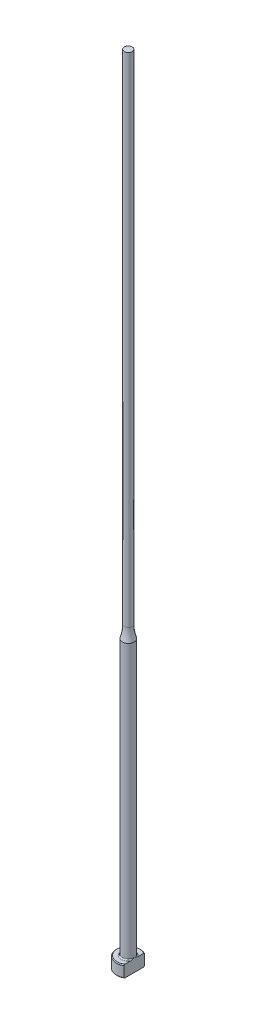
ISO-10303-21;
HEADER;
FILE_DESCRIPTION(('STEP AP214'),'2;1');
FILE_NAME('part.step','',(''),(''),'','','');
FILE_SCHEMA(('AUTOMOTIVE_DESIGN { 1 0 10303 214 1 1 1 1 }'));
ENDSEC;
DATA;
#1=APPLICATION_CONTEXT('core data for automotive mechanical design processes');
#2=APPLICATION_PROTOCOL_DEFINITION('international standard','automotive_design',2000,#1);
#3=PRODUCT_CONTEXT('',#1,'mechanical');
#4=PRODUCT('Part','Part','',(#3));
#5=PRODUCT_RELATED_PRODUCT_CATEGORY('part','',(#4));
#6=PRODUCT_DEFINITION_FORMATION('','',#4);
#7=PRODUCT_DEFINITION_CONTEXT('part definition',#1,'design');
#8=PRODUCT_DEFINITION('design','',#6,#7);
#9=PRODUCT_DEFINITION_SHAPE('','',#8);
#10=(LENGTH_UNIT() NAMED_UNIT(*) SI_UNIT(.MILLI.,.METRE.));
#11=(NAMED_UNIT(*) PLANE_ANGLE_UNIT() SI_UNIT($,.RADIAN.));
#12=(NAMED_UNIT(*) SI_UNIT($,.STERADIAN.) SOLID_ANGLE_UNIT());
#13=UNCERTAINTY_MEASURE_WITH_UNIT(LENGTH_MEASURE(1.E-05),#10,'distance_accuracy_value','');
#14=(GEOMETRIC_REPRESENTATION_CONTEXT(3) GLOBAL_UNCERTAINTY_ASSIGNED_CONTEXT((#13)) GLOBAL_UNIT_ASSIGNED_CONTEXT((#10,
#11,#12)) REPRESENTATION_CONTEXT('',''));
#15=CARTESIAN_POINT('',(0.,0.,0.));
#16=DIRECTION('',(0.,0.,1.));
#17=DIRECTION('',(1.,0.,0.));
#18=AXIS2_PLACEMENT_3D('',#15,#16,#17);
#19=CARTESIAN_POINT('',(-2.99999999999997,3.,0.));
#20=DIRECTION('',(0.,1.,0.));
#21=DIRECTION('',(0.,0.,1.));
#22=AXIS2_PLACEMENT_3D('',#19,#20,#21);
#23=PLANE('',#22);
#24=CARTESIAN_POINT('',(0.,3.,0.));
#25=DIRECTION('',(0.,1.,0.));
#26=DIRECTION('',(0.,0.,1.));
#27=AXIS2_PLACEMENT_3D('',#24,#25,#26);
#28=CIRCLE('',#27,2.79999999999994);
#29=CARTESIAN_POINT('',(1.49999999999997,3.,-2.36431808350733));
#30=VERTEX_POINT('',#29);
#31=CARTESIAN_POINT('',(1.49999999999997,3.,2.36431808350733));
#32=VERTEX_POINT('',#31);
#33=EDGE_CURVE('E187',#30,#32,#28,.T.);
#34=ORIENTED_EDGE('',*,*,#33,.T.);
#35=DIRECTION('',(0.,0.,-1.));
#36=VECTOR('',#35,1.);
#37=CARTESIAN_POINT('',(1.49999999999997,3.,0.));
#38=LINE('',#37,#36);
#39=CARTESIAN_POINT('',(1.49999999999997,3.00000000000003,0.99498743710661));
#40=VERTEX_POINT('',#39);
#41=EDGE_CURVE('E57',#32,#40,#38,.T.);
#42=ORIENTED_EDGE('',*,*,#41,.T.);
#43=CARTESIAN_POINT('',(0.,3.,0.));
#44=DIRECTION('',(0.,1.,0.));
#45=DIRECTION('',(0.,0.,1.));
#46=AXIS2_PLACEMENT_3D('',#43,#44,#45);
#47=CIRCLE('',#46,1.79999999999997);
#48=CARTESIAN_POINT('',(1.49999999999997,3.00000000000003,-0.994987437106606));
#49=VERTEX_POINT('',#48);
#50=EDGE_CURVE('E108',#40,#49,#47,.F.);
#51=ORIENTED_EDGE('',*,*,#50,.T.);
#52=EDGE_CURVE('E137',#49,#30,#38,.T.);
#53=ORIENTED_EDGE('',*,*,#52,.T.);
#54=EDGE_LOOP('',(#34,#42,#51,#53));
#55=FACE_BOUND('',#54,.T.);
#56=ADVANCED_FACE('F32',(#55),#23,.T.);
#57=CARTESIAN_POINT('',(0.,259.958771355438,0.));
#58=DIRECTION('',(0.,1.,0.));
#59=DIRECTION('',(0.,0.,1.));
#60=AXIS2_PLACEMENT_3D('',#57,#58,#59);
#61=CYLINDRICAL_SURFACE('',#60,2.99999999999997);
#62=CARTESIAN_POINT('',(0.,2.79999999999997,0.));
#63=DIRECTION('',(0.,1.,0.));
#64=DIRECTION('',(0.,0.,1.));
#65=AXIS2_PLACEMENT_3D('',#62,#63,#64);
#66=CIRCLE('',#65,2.99999999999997);
#67=CARTESIAN_POINT('',(1.49999999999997,2.79999999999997,2.5980762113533));
#68=VERTEX_POINT('',#67);
#69=CARTESIAN_POINT('',(1.49999999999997,2.79999999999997,-2.5980762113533));
#70=VERTEX_POINT('',#69);
#71=EDGE_CURVE('E105',#68,#70,#66,.F.);
#72=ORIENTED_EDGE('',*,*,#71,.T.);
#73=DIRECTION('',(0.,-1.,0.));
#74=VECTOR('',#73,1.);
#75=CARTESIAN_POINT('',(1.49999999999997,200.,-2.5980762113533));
#76=LINE('',#75,#74);
#77=CARTESIAN_POINT('',(1.49999999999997,0.200000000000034,-2.5980762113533));
#78=VERTEX_POINT('',#77);
#79=EDGE_CURVE('E193',#70,#78,#76,.T.);
#80=ORIENTED_EDGE('',*,*,#79,.T.);
#81=CARTESIAN_POINT('',(0.,0.200000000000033,0.));
#82=DIRECTION('',(0.,-1.,0.));
#83=DIRECTION('',(0.,0.,-1.));
#84=AXIS2_PLACEMENT_3D('',#81,#82,#83);
#85=CIRCLE('',#84,2.99999999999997);
#86=CARTESIAN_POINT('',(1.49999999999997,0.200000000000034,2.5980762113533));
#87=VERTEX_POINT('',#86);
#88=EDGE_CURVE('E100',#78,#87,#85,.F.);
#89=ORIENTED_EDGE('',*,*,#88,.T.);
#90=DIRECTION('',(0.,-1.,0.));
#91=VECTOR('',#90,1.);
#92=CARTESIAN_POINT('',(1.49999999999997,200.,2.5980762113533));
#93=LINE('',#92,#91);
#94=EDGE_CURVE('E93',#68,#87,#93,.T.);
#95=ORIENTED_EDGE('',*,*,#94,.F.);
#96=EDGE_LOOP('',(#72,#80,#89,#95));
#97=FACE_BOUND('',#96,.T.);
#98=ADVANCED_FACE('F158',(#97),#61,.T.);
#99=CARTESIAN_POINT('',(0.,0.,0.));
#100=DIRECTION('',(0.,-1.,0.));
#101=DIRECTION('',(0.,0.,-1.));
#102=AXIS2_PLACEMENT_3D('',#99,#100,#101);
#103=PLANE('',#102);
#104=CARTESIAN_POINT('',(0.,0.,0.));
#105=DIRECTION('',(0.,-1.,0.));
#106=DIRECTION('',(0.,0.,-1.));
#107=AXIS2_PLACEMENT_3D('',#104,#105,#106);
#108=CIRCLE('',#107,2.79999999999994);
#109=CARTESIAN_POINT('',(1.49999999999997,0.,2.36431808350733));
#110=VERTEX_POINT('',#109);
#111=CARTESIAN_POINT('',(1.49999999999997,0.,-2.36431808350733));
#112=VERTEX_POINT('',#111);
#113=EDGE_CURVE('E98',#110,#112,#108,.T.);
#114=ORIENTED_EDGE('',*,*,#113,.T.);
#115=DIRECTION('',(0.,0.,1.));
#116=VECTOR('',#115,1.);
#117=CARTESIAN_POINT('',(1.49999999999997,0.,-2.5980762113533));
#118=LINE('',#117,#116);
#119=EDGE_CURVE('E83',#112,#110,#118,.T.);
#120=ORIENTED_EDGE('',*,*,#119,.T.);
#121=EDGE_LOOP('',(#114,#120));
#122=FACE_BOUND('',#121,.T.);
#123=ADVANCED_FACE('F103',(#122),#103,.T.);
#124=CARTESIAN_POINT('',(0.,3.,0.));
#125=DIRECTION('',(0.,-1.,0.));
#126=DIRECTION('',(0.,0.,-1.));
#127=AXIS2_PLACEMENT_3D('',#124,#125,#126);
#128=CONICAL_SURFACE('',#127,2.79999999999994,0.785398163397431);
#129=ORIENTED_EDGE('',*,*,#71,.F.);
#130=CARTESIAN_POINT('',(1.49999999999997,-0.11174109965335,5.71827621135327));
#131=CARTESIAN_POINT('',(1.49999999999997,0.0136183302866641,5.58866816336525));
#132=CARTESIAN_POINT('',(1.49999999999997,0.138843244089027,5.45892957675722));
#133=CARTESIAN_POINT('',(1.49999999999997,0.388944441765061,5.19911365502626));
#134=CARTESIAN_POINT('',(1.49999999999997,0.513820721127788,5.06903631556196));
#135=CARTESIAN_POINT('',(1.49999999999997,0.763205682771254,4.80840180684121));
#136=CARTESIAN_POINT('',(1.49999999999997,0.887714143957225,4.67784442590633));
#137=CARTESIAN_POINT('',(1.49999999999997,1.13618059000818,4.4162081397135));
#138=CARTESIAN_POINT('',(1.49999999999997,1.26013857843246,4.28512923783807));
#139=CARTESIAN_POINT('',(1.49999999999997,1.50488975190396,4.02490837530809));
#140=CARTESIAN_POINT('',(1.49999999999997,1.62569693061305,3.8957795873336));
#141=CARTESIAN_POINT('',(1.49999999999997,1.86640694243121,3.63668213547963));
#142=CARTESIAN_POINT('',(1.49999999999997,1.98630978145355,3.50671347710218));
#143=CARTESIAN_POINT('',(1.49999999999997,2.2248603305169,3.24567921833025));
#144=CARTESIAN_POINT('',(1.49999999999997,2.3435083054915,3.11461386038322));
#145=CARTESIAN_POINT('',(1.49999999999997,2.5790771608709,2.85094268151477));
#146=CARTESIAN_POINT('',(1.49999999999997,2.69599811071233,2.71833692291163));
#147=CARTESIAN_POINT('',(1.49999999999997,2.88262371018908,2.50255231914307));
#148=CARTESIAN_POINT('',(1.49999999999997,2.95312454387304,2.42006293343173));
#149=CARTESIAN_POINT('',(1.49999999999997,3.09287098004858,2.25401084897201));
#150=CARTESIAN_POINT('',(1.49999999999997,3.16211645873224,2.17044804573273));
#151=CARTESIAN_POINT('',(1.49999999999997,3.29964684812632,2.00105967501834));
#152=CARTESIAN_POINT('',(1.49999999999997,3.36791386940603,1.9152195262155));
#153=CARTESIAN_POINT('',(1.49999999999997,3.50205840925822,1.7417139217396));
#154=CARTESIAN_POINT('',(1.49999999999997,3.56793649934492,1.65404891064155));
#155=CARTESIAN_POINT('',(1.49999999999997,3.69728151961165,1.47490236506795));
#156=CARTESIAN_POINT('',(1.49999999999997,3.76069661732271,1.38338308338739));
#157=CARTESIAN_POINT('',(1.49999999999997,3.88239539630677,1.19675661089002));
#158=CARTESIAN_POINT('',(1.49999999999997,3.94067201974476,1.10164473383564));
#159=CARTESIAN_POINT('',(1.49999999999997,4.048413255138,0.908008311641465));
#160=CARTESIAN_POINT('',(1.49999999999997,4.09797809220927,0.809540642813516));
#161=CARTESIAN_POINT('',(1.49999999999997,4.18432188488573,0.60719295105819));
#162=CARTESIAN_POINT('',(1.49999999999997,4.22114374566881,0.503332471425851));
#163=CARTESIAN_POINT('',(1.49999999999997,4.26099935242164,0.3475775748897));
#164=CARTESIAN_POINT('',(1.49999999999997,4.2715702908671,0.297609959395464));
#165=CARTESIAN_POINT('',(1.49999999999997,4.28794860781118,0.196885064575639));
#166=CARTESIAN_POINT('',(1.49999999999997,4.29375640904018,0.146127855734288));
#167=CARTESIAN_POINT('',(1.49999999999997,4.30019707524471,0.0444388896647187));
#168=CARTESIAN_POINT('',(1.49999999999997,4.30084594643,-0.00649183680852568));
#169=CARTESIAN_POINT('',(1.49999999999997,4.29696416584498,-0.108155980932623));
#170=CARTESIAN_POINT('',(1.49999999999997,4.29243308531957,-0.158889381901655));
#171=CARTESIAN_POINT('',(1.49999999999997,4.27856915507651,-0.259234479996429));
#172=CARTESIAN_POINT('',(1.49999999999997,4.2692782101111,-0.308852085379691));
#173=CARTESIAN_POINT('',(1.49999999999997,4.24647108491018,-0.407110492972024));
#174=CARTESIAN_POINT('',(1.49999999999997,4.23295324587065,-0.45575090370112));
#175=CARTESIAN_POINT('',(1.49999999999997,4.20226175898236,-0.55214996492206));
#176=CARTESIAN_POINT('',(1.49999999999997,4.18506801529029,-0.599902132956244));
#177=CARTESIAN_POINT('',(1.49999999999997,4.14771387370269,-0.694205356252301));
#178=CARTESIAN_POINT('',(1.49999999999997,4.12755408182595,-0.740756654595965));
#179=CARTESIAN_POINT('',(1.49999999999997,4.0632769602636,-0.879166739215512));
#180=CARTESIAN_POINT('',(1.49999999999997,4.01551721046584,-0.969329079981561));
#181=CARTESIAN_POINT('',(1.49999999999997,3.91367909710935,-1.14604316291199));
#182=CARTESIAN_POINT('',(1.49999999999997,3.85959300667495,-1.2325903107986));
#183=CARTESIAN_POINT('',(1.49999999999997,3.74697968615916,-1.40321348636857));
#184=CARTESIAN_POINT('',(1.49999999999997,3.68843573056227,-1.4872783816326));
#185=CARTESIAN_POINT('',(1.49999999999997,3.5684384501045,-1.65322187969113));
#186=CARTESIAN_POINT('',(1.49999999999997,3.50698656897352,-1.73510153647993));
#187=CARTESIAN_POINT('',(1.49999999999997,3.3811567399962,-1.89829823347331));
#188=CARTESIAN_POINT('',(1.49999999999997,3.31675092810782,-1.97959369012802));
#189=CARTESIAN_POINT('',(1.49999999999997,3.18634068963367,-2.14090082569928));
#190=CARTESIAN_POINT('',(1.49999999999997,3.12033609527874,-2.22091236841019));
#191=CARTESIAN_POINT('',(1.49999999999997,2.92086431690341,-2.45906508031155));
#192=CARTESIAN_POINT('',(1.49999999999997,2.78562663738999,-2.61572090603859));
#193=CARTESIAN_POINT('',(1.49999999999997,2.53554498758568,-2.90006295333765));
#194=CARTESIAN_POINT('',(1.49999999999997,2.42114543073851,-3.02814382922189));
#195=CARTESIAN_POINT('',(1.49999999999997,2.1909355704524,-3.28303767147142));
#196=CARTESIAN_POINT('',(1.49999999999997,2.07512522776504,-3.40985060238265));
#197=CARTESIAN_POINT('',(1.49999999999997,1.72597067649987,-3.78913849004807));
#198=CARTESIAN_POINT('',(1.49999999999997,1.49111760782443,-4.04022177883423));
#199=CARTESIAN_POINT('',(1.49999999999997,1.0288247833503,-4.52992803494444));
#200=CARTESIAN_POINT('',(1.49999999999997,0.801477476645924,-4.76863870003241));
#201=CARTESIAN_POINT('',(1.49999999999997,0.459548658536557,-5.12558036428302));
#202=CARTESIAN_POINT('',(1.49999999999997,0.345484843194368,-5.24430773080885));
#203=CARTESIAN_POINT('',(1.49999999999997,0.117071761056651,-5.48148573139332));
#204=CARTESIAN_POINT('',(1.49999999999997,0.00272249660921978,-5.59993636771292));
#205=CARTESIAN_POINT('',(1.49999999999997,-0.11174109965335,-5.71827621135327));
#206=B_SPLINE_CURVE_WITH_KNOTS('',3,(#130,#131,#132,#133,#134,#135,#136,#137,#138,#139,#140,
#141,#142,#143,#144,#145,#146,#147,#148,#149,#150,#151,#152,#153,#154,#155,#156,#157,#158,#159,
#160,#161,#162,#163,#164,#165,#166,#167,#168,#169,#170,#171,#172,#173,#174,#175,#176,#177,#178,
#179,#180,#181,#182,#183,#184,#185,#186,#187,#188,#189,#190,#191,#192,#193,#194,#195,#196,#197,
#198,#199,#200,#201,#202,#203,#204,#205),.UNSPECIFIED.,.F.,.F.,(4,2,2,2,2,2,2,2,2,2,2,2,2,2,2,2,
2,2,2,2,2,2,2,2,2,2,2,2,2,2,2,2,2,2,2,2,2,4),(0.,0.540943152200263,1.08189327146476,
1.62312052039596,2.16434426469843,2.69482920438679,3.22531067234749,3.75567781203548,
4.28602356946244,4.61155053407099,4.9371094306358,5.26610945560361,5.59503024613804,
5.92894782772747,6.26331713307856,6.59354403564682,6.92264800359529,7.07567478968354,
7.2286879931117,7.38122626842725,7.53377717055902,7.6850075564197,7.83629736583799,
7.98843643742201,8.14054446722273,8.44618799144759,8.75220879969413,9.05944044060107,
9.3665211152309,9.6776428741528,9.98879742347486,10.609592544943,11.1247803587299,
11.6399825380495,12.6713544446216,13.6603005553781,14.1542238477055,14.6481430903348),.UNSPECIFIED.);
#207=EDGE_CURVE('E136',#68,#32,#206,.T.);
#208=ORIENTED_EDGE('',*,*,#207,.T.);
#209=ORIENTED_EDGE('',*,*,#33,.F.);
#210=EDGE_CURVE('E128',#30,#70,#206,.T.);
#211=ORIENTED_EDGE('',*,*,#210,.T.);
#212=EDGE_LOOP('',(#129,#208,#209,#211));
#213=FACE_BOUND('',#212,.T.);
#214=ADVANCED_FACE('F144',(#213),#128,.T.);
#215=CARTESIAN_POINT('',(0.,0.200000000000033,0.));
#216=DIRECTION('',(0.,1.,0.));
#217=DIRECTION('',(0.,0.,1.));
#218=AXIS2_PLACEMENT_3D('',#215,#216,#217);
#219=CONICAL_SURFACE('',#218,2.99999999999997,0.785398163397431);
#220=ORIENTED_EDGE('',*,*,#88,.F.);
#221=CARTESIAN_POINT('',(1.49999999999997,3.11174109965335,-5.71827621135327));
#222=CARTESIAN_POINT('',(1.49999999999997,2.98638166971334,-5.58866816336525));
#223=CARTESIAN_POINT('',(1.49999999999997,2.86115675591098,-5.45892957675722));
#224=CARTESIAN_POINT('',(1.49999999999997,2.61105555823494,-5.19911365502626));
#225=CARTESIAN_POINT('',(1.49999999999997,2.48617927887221,-5.06903631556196));
#226=CARTESIAN_POINT('',(1.49999999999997,2.23679431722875,-4.80840180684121));
#227=CARTESIAN_POINT('',(1.49999999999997,2.11228585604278,-4.67784442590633));
#228=CARTESIAN_POINT('',(1.49999999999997,1.86381940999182,-4.4162081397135));
#229=CARTESIAN_POINT('',(1.49999999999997,1.73986142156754,-4.28512923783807));
#230=CARTESIAN_POINT('',(1.49999999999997,1.49511024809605,-4.02490837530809));
#231=CARTESIAN_POINT('',(1.49999999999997,1.37430306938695,-3.8957795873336));
#232=CARTESIAN_POINT('',(1.49999999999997,1.13359305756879,-3.63668213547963));
#233=CARTESIAN_POINT('',(1.49999999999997,1.01369021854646,-3.50671347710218));
#234=CARTESIAN_POINT('',(1.49999999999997,0.775139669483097,-3.24567921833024));
#235=CARTESIAN_POINT('',(1.49999999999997,0.656491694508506,-3.11461386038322));
#236=CARTESIAN_POINT('',(1.49999999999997,0.420922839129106,-2.85094268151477));
#237=CARTESIAN_POINT('',(1.49999999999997,0.304001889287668,-2.71833692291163));
#238=CARTESIAN_POINT('',(1.49999999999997,0.117376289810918,-2.50255231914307));
#239=CARTESIAN_POINT('',(1.49999999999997,0.0468754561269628,-2.42006293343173));
#240=CARTESIAN_POINT('',(1.49999999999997,-0.0928709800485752,-2.254010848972));
#241=CARTESIAN_POINT('',(1.49999999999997,-0.162116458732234,-2.17044804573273));
#242=CARTESIAN_POINT('',(1.49999999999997,-0.299646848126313,-2.00105967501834));
#243=CARTESIAN_POINT('',(1.49999999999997,-0.367913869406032,-1.9152195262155));
#244=CARTESIAN_POINT('',(1.49999999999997,-0.502058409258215,-1.7417139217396));
#245=CARTESIAN_POINT('',(1.49999999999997,-0.567936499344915,-1.65404891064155));
#246=CARTESIAN_POINT('',(1.49999999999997,-0.697281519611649,-1.47490236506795));
#247=CARTESIAN_POINT('',(1.49999999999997,-0.760696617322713,-1.38338308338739));
#248=CARTESIAN_POINT('',(1.49999999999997,-0.882395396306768,-1.19675661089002));
#249=CARTESIAN_POINT('',(1.49999999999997,-0.940672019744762,-1.10164473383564));
#250=CARTESIAN_POINT('',(1.49999999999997,-1.04841325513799,-0.908008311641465));
#251=CARTESIAN_POINT('',(1.49999999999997,-1.09797809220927,-0.809540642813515));
#252=CARTESIAN_POINT('',(1.49999999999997,-1.18432188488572,-0.607192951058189));
#253=CARTESIAN_POINT('',(1.49999999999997,-1.22114374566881,-0.503332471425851));
#254=CARTESIAN_POINT('',(1.49999999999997,-1.26099935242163,-0.3475775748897));
#255=CARTESIAN_POINT('',(1.49999999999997,-1.2715702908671,-0.297609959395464));
#256=CARTESIAN_POINT('',(1.49999999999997,-1.28794860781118,-0.19688506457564));
#257=CARTESIAN_POINT('',(1.49999999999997,-1.29375640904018,-0.146127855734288));
#258=CARTESIAN_POINT('',(1.49999999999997,-1.30019707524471,-0.0444388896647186));
#259=CARTESIAN_POINT('',(1.49999999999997,-1.30084594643,0.00649183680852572));
#260=CARTESIAN_POINT('',(1.49999999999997,-1.29696416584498,0.108155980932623));
#261=CARTESIAN_POINT('',(1.49999999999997,-1.29243308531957,0.158889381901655));
#262=CARTESIAN_POINT('',(1.49999999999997,-1.2785691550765,0.259234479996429));
#263=CARTESIAN_POINT('',(1.49999999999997,-1.2692782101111,0.308852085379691));
#264=CARTESIAN_POINT('',(1.49999999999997,-1.24647108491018,0.407110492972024));
#265=CARTESIAN_POINT('',(1.49999999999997,-1.23295324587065,0.45575090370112));
#266=CARTESIAN_POINT('',(1.49999999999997,-1.20226175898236,0.55214996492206));
#267=CARTESIAN_POINT('',(1.49999999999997,-1.18506801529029,0.599902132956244));
#268=CARTESIAN_POINT('',(1.49999999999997,-1.14771387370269,0.694205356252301));
#269=CARTESIAN_POINT('',(1.49999999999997,-1.12755408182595,0.740756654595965));
#270=CARTESIAN_POINT('',(1.49999999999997,-1.0632769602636,0.879166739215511));
#271=CARTESIAN_POINT('',(1.49999999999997,-1.01551721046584,0.96932907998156));
#272=CARTESIAN_POINT('',(1.49999999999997,-0.913679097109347,1.14604316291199));
#273=CARTESIAN_POINT('',(1.49999999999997,-0.85959300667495,1.2325903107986));
#274=CARTESIAN_POINT('',(1.49999999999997,-0.74697968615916,1.40321348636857));
#275=CARTESIAN_POINT('',(1.49999999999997,-0.688435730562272,1.4872783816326));
#276=CARTESIAN_POINT('',(1.49999999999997,-0.568438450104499,1.65322187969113));
#277=CARTESIAN_POINT('',(1.49999999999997,-0.50698656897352,1.73510153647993));
#278=CARTESIAN_POINT('',(1.49999999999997,-0.381156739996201,1.89829823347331));
#279=CARTESIAN_POINT('',(1.49999999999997,-0.316750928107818,1.97959369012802));
#280=CARTESIAN_POINT('',(1.49999999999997,-0.186340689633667,2.14090082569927));
#281=CARTESIAN_POINT('',(1.49999999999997,-0.120336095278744,2.22091236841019));
#282=CARTESIAN_POINT('',(1.49999999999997,0.0791356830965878,2.45906508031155));
#283=CARTESIAN_POINT('',(1.49999999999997,0.214373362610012,2.61572090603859));
#284=CARTESIAN_POINT('',(1.49999999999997,0.464455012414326,2.90006295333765));
#285=CARTESIAN_POINT('',(1.49999999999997,0.578854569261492,3.02814382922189));
#286=CARTESIAN_POINT('',(1.49999999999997,0.809064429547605,3.28303767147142));
#287=CARTESIAN_POINT('',(1.49999999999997,0.924874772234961,3.40985060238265));
#288=CARTESIAN_POINT('',(1.49999999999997,1.27402932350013,3.78913849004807));
#289=CARTESIAN_POINT('',(1.49999999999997,1.50888239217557,4.04022177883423));
#290=CARTESIAN_POINT('',(1.49999999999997,1.97117521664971,4.52992803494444));
#291=CARTESIAN_POINT('',(1.49999999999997,2.19852252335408,4.76863870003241));
#292=CARTESIAN_POINT('',(1.49999999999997,2.54045134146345,5.12558036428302));
#293=CARTESIAN_POINT('',(1.49999999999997,2.65451515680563,5.24430773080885));
#294=CARTESIAN_POINT('',(1.49999999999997,2.88292823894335,5.48148573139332));
#295=CARTESIAN_POINT('',(1.49999999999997,2.99727750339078,5.59993636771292));
#296=CARTESIAN_POINT('',(1.49999999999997,3.11174109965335,5.71827621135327));
#297=B_SPLINE_CURVE_WITH_KNOTS('',3,(#221,#222,#223,#224,#225,#226,#227,#228,#229,#230,#231,
#232,#233,#234,#235,#236,#237,#238,#239,#240,#241,#242,#243,#244,#245,#246,#247,#248,#249,#250,
#251,#252,#253,#254,#255,#256,#257,#258,#259,#260,#261,#262,#263,#264,#265,#266,#267,#268,#269,
#270,#271,#272,#273,#274,#275,#276,#277,#278,#279,#280,#281,#282,#283,#284,#285,#286,#287,#288,
#289,#290,#291,#292,#293,#294,#295,#296),.UNSPECIFIED.,.F.,.F.,(4,2,2,2,2,2,2,2,2,2,2,2,2,2,2,2,
2,2,2,2,2,2,2,2,2,2,2,2,2,2,2,2,2,2,2,2,2,4),(0.,0.540943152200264,1.08189327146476,
1.62312052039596,2.16434426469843,2.69482920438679,3.22531067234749,3.75567781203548,
4.28602356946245,4.611550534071,4.9371094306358,5.26610945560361,5.59503024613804,
5.92894782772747,6.26331713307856,6.59354403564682,6.92264800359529,7.07567478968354,
7.2286879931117,7.38122626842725,7.53377717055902,7.6850075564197,7.83629736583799,
7.98843643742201,8.14054446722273,8.44618799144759,8.75220879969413,9.05944044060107,
9.3665211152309,9.6776428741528,9.98879742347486,10.609592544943,11.1247803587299,
11.6399825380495,12.6713544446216,13.6603005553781,14.1542238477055,14.6481430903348),.UNSPECIFIED.);
#298=EDGE_CURVE('E86',#78,#112,#297,.T.);
#299=ORIENTED_EDGE('',*,*,#298,.T.);
#300=ORIENTED_EDGE('',*,*,#113,.F.);
#301=EDGE_CURVE('E89',#110,#87,#297,.T.);
#302=ORIENTED_EDGE('',*,*,#301,.T.);
#303=EDGE_LOOP('',(#220,#299,#300,#302));
#304=FACE_BOUND('',#303,.T.);
#305=ADVANCED_FACE('F97',(#304),#219,.T.);
#306=CARTESIAN_POINT('',(0.,3.30000000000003,0.));
#307=DIRECTION('',(0.,1.,0.));
#308=DIRECTION('',(0.,0.,1.));
#309=AXIS2_PLACEMENT_3D('',#306,#307,#308);
#310=TOROIDAL_SURFACE('',#309,1.79999999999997,0.3);
#311=CARTESIAN_POINT('',(1.49999999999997,3.30000000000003,0.));
#312=CARTESIAN_POINT('',(1.49999999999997,3.300000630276,3.41555678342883E-12));
#313=CARTESIAN_POINT('',(1.49999999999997,3.30000126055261,-1.15373640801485E-07));
#314=CARTESIAN_POINT('',(1.49999999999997,3.3000024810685,-4.90631575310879E-07));
#315=CARTESIAN_POINT('',(1.49999999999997,3.30000307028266,-7.53296670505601E-07));
#316=CARTESIAN_POINT('',(1.49999999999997,3.30000424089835,-1.38757096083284E-06));
#317=CARTESIAN_POINT('',(1.49999999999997,3.300004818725,-1.76563001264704E-06));
#318=CARTESIAN_POINT('',(1.49999999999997,3.30000591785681,-2.58768006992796E-06));
#319=CARTESIAN_POINT('',(1.49999999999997,3.30000643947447,-3.03127014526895E-06));
#320=CARTESIAN_POINT('',(1.49999999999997,3.30000815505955,-4.60021967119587E-06));
#321=CARTESIAN_POINT('',(1.49999999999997,3.30000927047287,-5.8124152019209E-06));
#322=CARTESIAN_POINT('',(1.49999999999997,3.30001128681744,-8.33989413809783E-06));
#323=CARTESIAN_POINT('',(1.49999999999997,3.30001219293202,-9.65128157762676E-06));
#324=CARTESIAN_POINT('',(1.49999999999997,3.30001551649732,-1.46782505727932E-05));
#325=CARTESIAN_POINT('',(1.49999999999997,3.30001775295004,-1.8517976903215E-05));
#326=CARTESIAN_POINT('',(1.49999999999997,3.30002148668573,-2.61616194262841E-05));
#327=CARTESIAN_POINT('',(1.49999999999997,3.30002302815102,-2.99447742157E-05));
#328=CARTESIAN_POINT('',(1.49999999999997,3.30002943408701,-4.58003743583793E-05));
#329=CARTESIAN_POINT('',(1.49999999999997,3.3000341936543,-5.79079078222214E-05));
#330=CARTESIAN_POINT('',(1.49999999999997,3.30004197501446,-8.07263755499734E-05));
#331=CARTESIAN_POINT('',(1.49999999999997,3.30004514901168,-9.13834709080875E-05));
#332=CARTESIAN_POINT('',(1.49999999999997,3.30006989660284,-0.000167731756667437));
#333=CARTESIAN_POINT('',(1.49999999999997,3.30010092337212,-0.000229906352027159));
#334=CARTESIAN_POINT('',(1.49999999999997,3.30021632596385,-0.000470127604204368));
#335=CARTESIAN_POINT('',(1.49999999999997,3.30029368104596,-0.000650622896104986));
#336=CARTESIAN_POINT('',(1.49999999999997,3.30059619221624,-0.00134589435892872));
#337=CARTESIAN_POINT('',(1.49999999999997,3.30082870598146,-0.00185814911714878));
#338=CARTESIAN_POINT('',(1.49999999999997,3.30176696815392,-0.00393547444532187));
#339=CARTESIAN_POINT('',(1.49999999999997,3.30246445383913,-0.00550332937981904));
#340=CARTESIAN_POINT('',(1.49999999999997,3.31426785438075,-0.0320229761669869));
#341=CARTESIAN_POINT('',(1.49999999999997,3.32544800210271,-0.0569503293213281));
#342=CARTESIAN_POINT('',(1.49999999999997,3.34725700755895,-0.105984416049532));
#343=CARTESIAN_POINT('',(1.49999999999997,3.35789134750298,-0.130088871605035));
#344=CARTESIAN_POINT('',(1.49999999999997,3.38015321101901,-0.181096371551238));
#345=CARTESIAN_POINT('',(1.49999999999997,3.39175804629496,-0.208009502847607));
#346=CARTESIAN_POINT('',(1.49999999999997,3.41469034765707,-0.262264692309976));
#347=CARTESIAN_POINT('',(1.49999999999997,3.42601398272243,-0.289608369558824));
#348=CARTESIAN_POINT('',(1.49999999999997,3.45363212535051,-0.35820378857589));
#349=CARTESIAN_POINT('',(1.49999999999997,3.46959026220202,-0.39959288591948));
#350=CARTESIAN_POINT('',(1.49999999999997,3.49940505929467,-0.482097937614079));
#351=CARTESIAN_POINT('',(1.49999999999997,3.51330033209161,-0.523199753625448));
#352=CARTESIAN_POINT('',(1.49999999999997,3.53552507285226,-0.595497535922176));
#353=CARTESIAN_POINT('',(1.49999999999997,3.54436834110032,-0.626532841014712));
#354=CARTESIAN_POINT('',(1.49999999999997,3.56052427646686,-0.6891760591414));
#355=CARTESIAN_POINT('',(1.49999999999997,3.5678279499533,-0.720786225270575));
#356=CARTESIAN_POINT('',(1.49999999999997,3.5875075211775,-0.819524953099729));
#357=CARTESIAN_POINT('',(1.49999999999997,3.59661044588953,-0.88742909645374));
#358=CARTESIAN_POINT('',(1.49999999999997,3.60059842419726,-0.991180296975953));
#359=CARTESIAN_POINT('',(1.49999999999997,3.60019840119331,-1.02684364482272));
#360=CARTESIAN_POINT('',(1.49999999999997,3.59497085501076,-1.097505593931));
#361=CARTESIAN_POINT('',(1.49999999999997,3.59019295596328,-1.13250716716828));
#362=CARTESIAN_POINT('',(1.49999999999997,3.57687734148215,-1.19353096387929));
#363=CARTESIAN_POINT('',(1.49999999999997,3.56943875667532,-1.21978854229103));
#364=CARTESIAN_POINT('',(1.49999999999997,3.55063748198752,-1.27094658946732));
#365=CARTESIAN_POINT('',(1.49999999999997,3.53927342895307,-1.29584658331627));
#366=CARTESIAN_POINT('',(1.49999999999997,3.51660016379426,-1.33501873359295));
#367=CARTESIAN_POINT('',(1.49999999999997,3.50657738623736,-1.35003296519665));
#368=CARTESIAN_POINT('',(1.49999999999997,3.48437469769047,-1.37837252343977));
#369=CARTESIAN_POINT('',(1.49999999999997,3.47219867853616,-1.39170082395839));
#370=CARTESIAN_POINT('',(1.49999999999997,3.44835614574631,-1.41349417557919));
#371=CARTESIAN_POINT('',(1.49999999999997,3.43709185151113,-1.42239673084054));
#372=CARTESIAN_POINT('',(1.49999999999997,3.41325256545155,-1.43825467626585));
#373=CARTESIAN_POINT('',(1.49999999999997,3.40067804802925,-1.44521076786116));
#374=CARTESIAN_POINT('',(1.49999999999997,3.37433767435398,-1.45677158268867));
#375=CARTESIAN_POINT('',(1.49999999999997,3.36056203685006,-1.46135438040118));
#376=CARTESIAN_POINT('',(1.49999999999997,3.33237324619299,-1.46767730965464));
#377=CARTESIAN_POINT('',(1.49999999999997,3.31796076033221,-1.46942034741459));
#378=CARTESIAN_POINT('',(1.49999999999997,3.29122479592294,-1.4698720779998));
#379=CARTESIAN_POINT('',(1.49999999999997,3.27890664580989,-1.468990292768));
#380=CARTESIAN_POINT('',(1.49999999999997,3.25461019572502,-1.4651157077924));
#381=CARTESIAN_POINT('',(1.49999999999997,3.2426318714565,-1.46212305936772));
#382=CARTESIAN_POINT('',(1.49999999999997,3.21959683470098,-1.4543117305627));
#383=CARTESIAN_POINT('',(1.49999999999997,3.20852542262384,-1.44953579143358));
#384=CARTESIAN_POINT('',(1.49999999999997,3.18721125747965,-1.43840957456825));
#385=CARTESIAN_POINT('',(1.49999999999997,3.1769687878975,-1.43205876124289));
#386=CARTESIAN_POINT('',(1.49999999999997,3.15325976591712,-1.41506353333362));
#387=CARTESIAN_POINT('',(1.49999999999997,3.14027750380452,-1.40374235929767));
#388=CARTESIAN_POINT('',(1.49999999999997,3.11630720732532,-1.37914825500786));
#389=CARTESIAN_POINT('',(1.49999999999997,3.10532420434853,-1.36587054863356));
#390=CARTESIAN_POINT('',(1.49999999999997,3.08100891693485,-1.33197272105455));
#391=CARTESIAN_POINT('',(1.49999999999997,3.06867625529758,-1.31063843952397));
#392=CARTESIAN_POINT('',(1.49999999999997,3.04751867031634,-1.26637455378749));
#393=CARTESIAN_POINT('',(1.49999999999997,3.03869240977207,-1.24344556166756));
#394=CARTESIAN_POINT('',(1.49999999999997,3.01978360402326,-1.18316534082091));
#395=CARTESIAN_POINT('',(1.49999999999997,3.01191472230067,-1.14512623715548));
#396=CARTESIAN_POINT('',(1.49999999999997,3.00188285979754,-1.06789971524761));
#397=CARTESIAN_POINT('',(1.49999999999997,2.99979735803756,-1.02870374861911));
#398=CARTESIAN_POINT('',(1.49999999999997,3.00021727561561,-0.953160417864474));
#399=CARTESIAN_POINT('',(1.49999999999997,3.00240673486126,-0.916808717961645));
#400=CARTESIAN_POINT('',(1.49999999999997,3.0099643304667,-0.844432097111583));
#401=CARTESIAN_POINT('',(1.49999999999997,3.01533462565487,-0.808407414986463));
#402=CARTESIAN_POINT('',(1.49999999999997,3.02828086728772,-0.738670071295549));
#403=CARTESIAN_POINT('',(1.49999999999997,3.03573028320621,-0.704933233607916));
#404=CARTESIAN_POINT('',(1.49999999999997,3.05243174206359,-0.638128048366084));
#405=CARTESIAN_POINT('',(1.49999999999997,3.06167285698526,-0.605056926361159));
#406=CARTESIAN_POINT('',(1.49999999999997,3.08440652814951,-0.53019513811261));
#407=CARTESIAN_POINT('',(1.49999999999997,3.09836576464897,-0.488547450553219));
#408=CARTESIAN_POINT('',(1.49999999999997,3.1283820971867,-0.404954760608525));
#409=CARTESIAN_POINT('',(1.49999999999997,3.14447968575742,-0.363024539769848));
#410=CARTESIAN_POINT('',(1.49999999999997,3.17238454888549,-0.293508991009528));
#411=CARTESIAN_POINT('',(1.49999999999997,3.18384249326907,-0.265781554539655));
#412=CARTESIAN_POINT('',(1.49999999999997,3.20705854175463,-0.210769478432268));
#413=CARTESIAN_POINT('',(1.49999999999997,3.21881265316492,-0.183483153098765));
#414=CARTESIAN_POINT('',(1.49999999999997,3.24136702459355,-0.131772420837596));
#415=CARTESIAN_POINT('',(1.49999999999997,3.25214361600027,-0.107337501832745));
#416=CARTESIAN_POINT('',(1.49999999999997,3.27424746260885,-0.0576321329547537));
#417=CARTESIAN_POINT('',(1.49999999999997,3.28558038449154,-0.0323640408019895));
#418=CARTESIAN_POINT('',(1.49999999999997,3.29753556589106,-0.00550327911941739));
#419=CARTESIAN_POINT('',(1.49999999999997,3.29823307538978,-0.00393537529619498));
#420=CARTESIAN_POINT('',(1.49999999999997,3.29917134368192,-0.00185803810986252));
#421=CARTESIAN_POINT('',(1.49999999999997,3.29940384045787,-0.00134582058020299));
#422=CARTESIAN_POINT('',(1.49999999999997,3.29970633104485,-0.000650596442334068));
#423=CARTESIAN_POINT('',(1.49999999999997,3.29978368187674,-0.000470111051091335));
#424=CARTESIAN_POINT('',(1.49999999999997,3.29989907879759,-0.000229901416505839));
#425=CARTESIAN_POINT('',(1.49999999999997,3.29993010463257,-0.000167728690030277));
#426=CARTESIAN_POINT('',(1.49999999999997,3.29995485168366,-9.13825689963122E-05));
#427=CARTESIAN_POINT('',(1.49999999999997,3.29995802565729,-8.07256241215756E-05));
#428=CARTESIAN_POINT('',(1.49999999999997,3.29996580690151,-5.79074820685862E-05));
#429=CARTESIAN_POINT('',(1.49999999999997,3.29997056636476,-4.5800119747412E-05));
#430=CARTESIAN_POINT('',(1.49999999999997,3.29997697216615,-2.99447119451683E-05));
#431=CARTESIAN_POINT('',(1.49999999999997,3.2999785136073,-2.61615817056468E-05));
#432=CARTESIAN_POINT('',(1.49999999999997,3.2999822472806,-1.85179845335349E-05));
#433=CARTESIAN_POINT('',(1.49999999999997,3.29998448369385,-1.46782782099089E-05));
#434=CARTESIAN_POINT('',(1.49999999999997,3.2999878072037,-9.65132752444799E-06));
#435=CARTESIAN_POINT('',(1.49999999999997,3.299988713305,-8.33994202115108E-06));
#436=CARTESIAN_POINT('',(1.49999999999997,3.29999072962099,-5.81246426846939E-06));
#437=CARTESIAN_POINT('',(1.49999999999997,3.29999184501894,-4.600267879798E-06));
#438=CARTESIAN_POINT('',(1.49999999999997,3.29999356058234,-3.03131394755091E-06));
#439=CARTESIAN_POINT('',(1.49999999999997,3.29999408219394,-2.58772196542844E-06));
#440=CARTESIAN_POINT('',(1.49999999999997,3.2999951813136,-1.76566701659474E-06));
#441=CARTESIAN_POINT('',(1.49999999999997,3.29999575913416,-1.38760497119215E-06));
#442=CARTESIAN_POINT('',(1.49999999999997,3.29999692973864,-7.53323425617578E-07));
#443=CARTESIAN_POINT('',(1.49999999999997,3.29999751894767,-4.90654189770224E-07));
#444=CARTESIAN_POINT('',(1.49999999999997,3.29999873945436,-1.15386267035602E-07));
#445=CARTESIAN_POINT('',(1.49999999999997,3.29999936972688,-3.41554144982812E-12));
#446=CARTESIAN_POINT('',(1.49999999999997,3.30000000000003,0.));
#447=B_SPLINE_CURVE_WITH_KNOTS('',3,(#311,#312,#313,#314,#315,#316,#317,#318,#319,#320,#321,
#322,#323,#324,#325,#326,#327,#328,#329,#330,#331,#332,#333,#334,#335,#336,#337,#338,#339,#340,
#341,#342,#343,#344,#345,#346,#347,#348,#349,#350,#351,#352,#353,#354,#355,#356,#357,#358,#359,
#360,#361,#362,#363,#364,#365,#366,#367,#368,#369,#370,#371,#372,#373,#374,#375,#376,#377,#378,
#379,#380,#381,#382,#383,#384,#385,#386,#387,#388,#389,#390,#391,#392,#393,#394,#395,#396,#397,
#398,#399,#400,#401,#402,#403,#404,#405,#406,#407,#408,#409,#410,#411,#412,#413,#414,#415,#416,
#417,#418,#419,#420,#421,#422,#423,#424,#425,#426,#427,#428,#429,#430,#431,#432,#433,#434,#435,
#436,#437,#438,#439,#440,#441,#442,#443,#444,#445,#446),.UNSPECIFIED.,.T.,.F.,(4,2,2,2,2,2,2,2,
2,2,2,2,2,2,2,2,2,2,2,2,2,2,2,2,2,2,2,2,2,2,2,2,2,2,2,2,2,2,2,2,2,2,2,2,2,2,2,2,2,2,2,2,2,2,2,2,
2,2,2,2,2,2,2,2,2,2,2,4),(0.,1.88906036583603E-06,3.8150959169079E-06,5.87892837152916E-06,
7.93062024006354E-06,1.28480890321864E-05,1.76261717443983E-05,3.0909918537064E-05,
4.31529750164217E-05,8.21699329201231E-05,0.000115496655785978,0.000323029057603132,
0.000912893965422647,0.00259963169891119,0.00774858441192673,0.0896975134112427,
0.168737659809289,0.256660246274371,0.345444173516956,0.478492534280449,0.608603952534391,
0.705372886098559,0.802692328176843,1.00719557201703,1.11399616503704,1.21960092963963,
1.30124317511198,1.38291380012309,1.43690814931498,1.49080588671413,1.53371524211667,
1.57660911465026,1.61989249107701,1.66313154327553,1.69999492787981,1.73685567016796,
1.77288440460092,1.80892540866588,1.86031324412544,1.91182866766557,1.98534297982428,
2.05882922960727,2.1747172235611,2.29215041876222,2.40123170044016,2.51038710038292,
2.613972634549,2.71694519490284,2.84866234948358,2.98337525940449,3.07337666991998,
3.16250453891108,3.24262397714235,3.32569301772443,3.3308421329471,3.33252874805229,
3.33311858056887,3.33332610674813,3.33335943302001,3.33339844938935,3.3334106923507,
3.33342397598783,3.33342875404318,3.33343367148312,3.33343572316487,3.33343778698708,
3.33343971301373,3.33344160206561),.UNSPECIFIED.);
#448=CARTESIAN_POINT('',(1.49999999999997,3.30000000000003,0.));
#449=VERTEX_POINT('',#448);
#450=EDGE_CURVE('E11',#49,#449,#447,.T.);
#451=ORIENTED_EDGE('',*,*,#450,.F.);
#452=ORIENTED_EDGE('',*,*,#50,.F.);
#453=CARTESIAN_POINT('',(1.49999999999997,3.30000000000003,0.));
#454=CARTESIAN_POINT('',(1.49999999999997,3.29999936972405,-3.41547770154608E-12));
#455=CARTESIAN_POINT('',(1.49999999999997,3.29999873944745,1.15373640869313E-07));
#456=CARTESIAN_POINT('',(1.49999999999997,3.29999751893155,4.90631575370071E-07));
#457=CARTESIAN_POINT('',(1.49999999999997,3.29999692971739,7.53296670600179E-07));
#458=CARTESIAN_POINT('',(1.49999999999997,3.2999957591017,1.38757096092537E-06));
#459=CARTESIAN_POINT('',(1.49999999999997,3.29999518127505,1.76563001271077E-06));
#460=CARTESIAN_POINT('',(1.49999999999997,3.29999408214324,2.58768007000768E-06));
#461=CARTESIAN_POINT('',(1.49999999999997,3.29999356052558,3.03127014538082E-06));
#462=CARTESIAN_POINT('',(1.49999999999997,3.2999918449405,4.60021967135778E-06));
#463=CARTESIAN_POINT('',(1.49999999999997,3.29999072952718,5.81241520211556E-06));
#464=CARTESIAN_POINT('',(1.49999999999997,3.29998871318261,8.33989413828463E-06));
#465=CARTESIAN_POINT('',(1.49999999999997,3.29998780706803,9.65128157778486E-06));
#466=CARTESIAN_POINT('',(1.49999999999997,3.29998448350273,1.46782505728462E-05));
#467=CARTESIAN_POINT('',(1.49999999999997,3.29998224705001,1.85179769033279E-05));
#468=CARTESIAN_POINT('',(1.49999999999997,3.29997851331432,2.61616194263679E-05));
#469=CARTESIAN_POINT('',(1.49999999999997,3.29997697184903,2.99447742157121E-05));
#470=CARTESIAN_POINT('',(1.49999999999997,3.29997056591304,4.58003743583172E-05));
#471=CARTESIAN_POINT('',(1.49999999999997,3.29996580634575,5.79079078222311E-05));
#472=CARTESIAN_POINT('',(1.49999999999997,3.29995802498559,8.07263755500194E-05));
#473=CARTESIAN_POINT('',(1.49999999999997,3.29995485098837,9.1383470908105E-05));
#474=CARTESIAN_POINT('',(1.49999999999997,3.29993010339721,0.000167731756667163));
#475=CARTESIAN_POINT('',(1.49999999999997,3.29989907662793,0.000229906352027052));
#476=CARTESIAN_POINT('',(1.49999999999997,3.2997836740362,0.000470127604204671));
#477=CARTESIAN_POINT('',(1.49999999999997,3.2997063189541,0.000650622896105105));
#478=CARTESIAN_POINT('',(1.49999999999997,3.29940380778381,0.00134589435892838));
#479=CARTESIAN_POINT('',(1.49999999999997,3.29917129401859,0.00185814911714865));
#480=CARTESIAN_POINT('',(1.49999999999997,3.29823303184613,0.00393547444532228));
#481=CARTESIAN_POINT('',(1.49999999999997,3.29753554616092,0.00550332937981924));
#482=CARTESIAN_POINT('',(1.49999999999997,3.2857321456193,0.0320229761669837));
#483=CARTESIAN_POINT('',(1.49999999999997,3.27455199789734,0.0569503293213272));
#484=CARTESIAN_POINT('',(1.49999999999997,3.2527429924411,0.105984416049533));
#485=CARTESIAN_POINT('',(1.49999999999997,3.24210865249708,0.130088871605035));
#486=CARTESIAN_POINT('',(1.49999999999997,3.21984678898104,0.181096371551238));
#487=CARTESIAN_POINT('',(1.49999999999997,3.20824195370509,0.208009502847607));
#488=CARTESIAN_POINT('',(1.49999999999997,3.18530965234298,0.262264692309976));
#489=CARTESIAN_POINT('',(1.49999999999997,3.17398601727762,0.289608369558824));
#490=CARTESIAN_POINT('',(1.49999999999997,3.14636787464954,0.35820378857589));
#491=CARTESIAN_POINT('',(1.49999999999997,3.13040973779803,0.39959288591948));
#492=CARTESIAN_POINT('',(1.49999999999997,3.10059494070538,0.482097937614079));
#493=CARTESIAN_POINT('',(1.49999999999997,3.08669966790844,0.523199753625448));
#494=CARTESIAN_POINT('',(1.49999999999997,3.06447492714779,0.595497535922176));
#495=CARTESIAN_POINT('',(1.49999999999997,3.05563165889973,0.626532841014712));
#496=CARTESIAN_POINT('',(1.49999999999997,3.03947572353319,0.6891760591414));
#497=CARTESIAN_POINT('',(1.49999999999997,3.03217205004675,0.720786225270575));
#498=CARTESIAN_POINT('',(1.49999999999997,3.01249247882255,0.819524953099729));
#499=CARTESIAN_POINT('',(1.49999999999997,3.00338955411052,0.88742909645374));
#500=CARTESIAN_POINT('',(1.49999999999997,2.99940157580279,0.991180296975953));
#501=CARTESIAN_POINT('',(1.49999999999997,2.99980159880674,1.02684364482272));
#502=CARTESIAN_POINT('',(1.49999999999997,3.00502914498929,1.097505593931));
#503=CARTESIAN_POINT('',(1.49999999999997,3.00980704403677,1.13250716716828));
#504=CARTESIAN_POINT('',(1.49999999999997,3.0231226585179,1.19353096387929));
#505=CARTESIAN_POINT('',(1.49999999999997,3.03056124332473,1.21978854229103));
#506=CARTESIAN_POINT('',(1.49999999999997,3.04936251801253,1.27094658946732));
#507=CARTESIAN_POINT('',(1.49999999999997,3.06072657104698,1.29584658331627));
#508=CARTESIAN_POINT('',(1.49999999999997,3.08339983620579,1.33501873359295));
#509=CARTESIAN_POINT('',(1.49999999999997,3.09342261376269,1.35003296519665));
#510=CARTESIAN_POINT('',(1.49999999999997,3.11562530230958,1.37837252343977));
#511=CARTESIAN_POINT('',(1.49999999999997,3.12780132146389,1.39170082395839));
#512=CARTESIAN_POINT('',(1.49999999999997,3.15164385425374,1.41349417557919));
#513=CARTESIAN_POINT('',(1.49999999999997,3.16290814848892,1.42239673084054));
#514=CARTESIAN_POINT('',(1.49999999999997,3.1867474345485,1.43825467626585));
#515=CARTESIAN_POINT('',(1.49999999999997,3.1993219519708,1.44521076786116));
#516=CARTESIAN_POINT('',(1.49999999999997,3.22566232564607,1.45677158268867));
#517=CARTESIAN_POINT('',(1.49999999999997,3.23943796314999,1.46135438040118));
#518=CARTESIAN_POINT('',(1.49999999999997,3.26762675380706,1.46767730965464));
#519=CARTESIAN_POINT('',(1.49999999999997,3.28203923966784,1.46942034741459));
#520=CARTESIAN_POINT('',(1.49999999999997,3.30877520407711,1.4698720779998));
#521=CARTESIAN_POINT('',(1.49999999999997,3.32109335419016,1.468990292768));
#522=CARTESIAN_POINT('',(1.49999999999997,3.34538980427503,1.4651157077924));
#523=CARTESIAN_POINT('',(1.49999999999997,3.35736812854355,1.46212305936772));
#524=CARTESIAN_POINT('',(1.49999999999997,3.38040316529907,1.4543117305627));
#525=CARTESIAN_POINT('',(1.49999999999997,3.39147457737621,1.44953579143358));
#526=CARTESIAN_POINT('',(1.49999999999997,3.4127887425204,1.43840957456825));
#527=CARTESIAN_POINT('',(1.49999999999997,3.42303121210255,1.43205876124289));
#528=CARTESIAN_POINT('',(1.49999999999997,3.44674023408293,1.41506353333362));
#529=CARTESIAN_POINT('',(1.49999999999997,3.45972249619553,1.40374235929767));
#530=CARTESIAN_POINT('',(1.49999999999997,3.48369279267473,1.37914825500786));
#531=CARTESIAN_POINT('',(1.49999999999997,3.49467579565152,1.36587054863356));
#532=CARTESIAN_POINT('',(1.49999999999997,3.5189910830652,1.33197272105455));
#533=CARTESIAN_POINT('',(1.49999999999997,3.53132374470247,1.31063843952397));
#534=CARTESIAN_POINT('',(1.49999999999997,3.55248132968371,1.26637455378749));
#535=CARTESIAN_POINT('',(1.49999999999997,3.56130759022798,1.24344556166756));
#536=CARTESIAN_POINT('',(1.49999999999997,3.58021639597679,1.18316534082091));
#537=CARTESIAN_POINT('',(1.49999999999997,3.58808527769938,1.14512623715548));
#538=CARTESIAN_POINT('',(1.49999999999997,3.59811714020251,1.06789971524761));
#539=CARTESIAN_POINT('',(1.49999999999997,3.60020264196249,1.02870374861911));
#540=CARTESIAN_POINT('',(1.49999999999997,3.59978272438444,0.953160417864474));
#541=CARTESIAN_POINT('',(1.49999999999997,3.59759326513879,0.916808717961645));
#542=CARTESIAN_POINT('',(1.49999999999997,3.59003566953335,0.844432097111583));
#543=CARTESIAN_POINT('',(1.49999999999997,3.58466537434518,0.808407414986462));
#544=CARTESIAN_POINT('',(1.49999999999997,3.57171913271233,0.738670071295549));
#545=CARTESIAN_POINT('',(1.49999999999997,3.56426971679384,0.704933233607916));
#546=CARTESIAN_POINT('',(1.49999999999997,3.54756825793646,0.638128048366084));
#547=CARTESIAN_POINT('',(1.49999999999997,3.53832714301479,0.605056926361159));
#548=CARTESIAN_POINT('',(1.49999999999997,3.51559347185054,0.53019513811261));
#549=CARTESIAN_POINT('',(1.49999999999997,3.50163423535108,0.488547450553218));
#550=CARTESIAN_POINT('',(1.49999999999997,3.47161790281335,0.404954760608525));
#551=CARTESIAN_POINT('',(1.49999999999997,3.45552031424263,0.363024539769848));
#552=CARTESIAN_POINT('',(1.49999999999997,3.42761545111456,0.293508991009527));
#553=CARTESIAN_POINT('',(1.49999999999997,3.41615750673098,0.265781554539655));
#554=CARTESIAN_POINT('',(1.49999999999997,3.39294145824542,0.210769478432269));
#555=CARTESIAN_POINT('',(1.49999999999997,3.38118734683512,0.183483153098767));
#556=CARTESIAN_POINT('',(1.49999999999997,3.3586329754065,0.131772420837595));
#557=CARTESIAN_POINT('',(1.49999999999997,3.3478563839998,0.10733750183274));
#558=CARTESIAN_POINT('',(1.49999999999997,3.32575253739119,0.0576321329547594));
#559=CARTESIAN_POINT('',(1.49999999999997,3.31441961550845,0.0323640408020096));
#560=CARTESIAN_POINT('',(1.49999999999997,3.30246443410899,0.00550327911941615));
#561=CARTESIAN_POINT('',(1.49999999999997,3.30176692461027,0.00393537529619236));
#562=CARTESIAN_POINT('',(1.49999999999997,3.30082865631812,0.00185803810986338));
#563=CARTESIAN_POINT('',(1.49999999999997,3.30059615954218,0.00134582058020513));
#564=CARTESIAN_POINT('',(1.49999999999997,3.3002936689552,0.000650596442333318));
#565=CARTESIAN_POINT('',(1.49999999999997,3.30021631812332,0.000470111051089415));
#566=CARTESIAN_POINT('',(1.49999999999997,3.30010092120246,0.000229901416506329));
#567=CARTESIAN_POINT('',(1.49999999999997,3.30006989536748,0.000167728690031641));
#568=CARTESIAN_POINT('',(1.49999999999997,3.30004514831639,9.13825689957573E-05));
#569=CARTESIAN_POINT('',(1.49999999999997,3.30004197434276,8.07256241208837E-05));
#570=CARTESIAN_POINT('',(1.49999999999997,3.30003419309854,5.79074820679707E-05));
#571=CARTESIAN_POINT('',(1.49999999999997,3.30002943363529,4.58001197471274E-05));
#572=CARTESIAN_POINT('',(1.49999999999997,3.3000230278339,2.99447119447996E-05));
#573=CARTESIAN_POINT('',(1.49999999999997,3.30002148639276,2.61615817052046E-05));
#574=CARTESIAN_POINT('',(1.49999999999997,3.30001775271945,1.85179845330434E-05));
#575=CARTESIAN_POINT('',(1.49999999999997,3.3000155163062,1.46782782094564E-05));
#576=CARTESIAN_POINT('',(1.49999999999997,3.30001219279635,9.65132752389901E-06));
#577=CARTESIAN_POINT('',(1.49999999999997,3.30001128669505,8.33994202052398E-06));
#578=CARTESIAN_POINT('',(1.49999999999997,3.30000927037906,5.8124642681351E-06));
#579=CARTESIAN_POINT('',(1.49999999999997,3.30000815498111,4.60026787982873E-06));
#580=CARTESIAN_POINT('',(1.49999999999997,3.30000643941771,3.03131394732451E-06));
#581=CARTESIAN_POINT('',(1.49999999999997,3.30000591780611,2.58772196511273E-06));
#582=CARTESIAN_POINT('',(1.49999999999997,3.30000481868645,1.76566701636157E-06));
#583=CARTESIAN_POINT('',(1.49999999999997,3.30000424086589,1.38760497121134E-06));
#584=CARTESIAN_POINT('',(1.49999999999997,3.3000030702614,7.53323425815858E-07));
#585=CARTESIAN_POINT('',(1.49999999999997,3.30000248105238,4.90654189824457E-07));
#586=CARTESIAN_POINT('',(1.49999999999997,3.30000126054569,1.15386266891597E-07));
#587=CARTESIAN_POINT('',(1.49999999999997,3.30000063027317,3.41546236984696E-12));
#588=CARTESIAN_POINT('',(1.49999999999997,3.30000000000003,0.));
#589=B_SPLINE_CURVE_WITH_KNOTS('',3,(#453,#454,#455,#456,#457,#458,#459,#460,#461,#462,#463,
#464,#465,#466,#467,#468,#469,#470,#471,#472,#473,#474,#475,#476,#477,#478,#479,#480,#481,#482,
#483,#484,#485,#486,#487,#488,#489,#490,#491,#492,#493,#494,#495,#496,#497,#498,#499,#500,#501,
#502,#503,#504,#505,#506,#507,#508,#509,#510,#511,#512,#513,#514,#515,#516,#517,#518,#519,#520,
#521,#522,#523,#524,#525,#526,#527,#528,#529,#530,#531,#532,#533,#534,#535,#536,#537,#538,#539,
#540,#541,#542,#543,#544,#545,#546,#547,#548,#549,#550,#551,#552,#553,#554,#555,#556,#557,#558,
#559,#560,#561,#562,#563,#564,#565,#566,#567,#568,#569,#570,#571,#572,#573,#574,#575,#576,#577,
#578,#579,#580,#581,#582,#583,#584,#585,#586,#587,#588),.UNSPECIFIED.,.T.,.F.,(4,2,2,2,2,2,2,2,
2,2,2,2,2,2,2,2,2,2,2,2,2,2,2,2,2,2,2,2,2,2,2,2,2,2,2,2,2,2,2,2,2,2,2,2,2,2,2,2,2,2,2,2,2,2,2,2,
2,2,2,2,2,2,2,2,2,2,2,4),(0.,1.88906036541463E-06,3.81509591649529E-06,5.87892837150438E-06,
7.93062024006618E-06,1.28480890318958E-05,1.76261717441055E-05,3.09099185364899E-05,
4.3152975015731E-05,8.21699329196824E-05,0.000115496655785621,0.000323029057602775,
0.000912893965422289,0.00259963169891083,0.00774858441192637,0.0896975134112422,
0.168737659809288,0.256660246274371,0.345444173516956,0.478492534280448,0.60860395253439,
0.705372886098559,0.802692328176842,1.00719557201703,1.11399616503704,1.21960092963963,
1.30124317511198,1.38291380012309,1.43690814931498,1.49080588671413,1.53371524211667,
1.57660911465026,1.61989249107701,1.66313154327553,1.69999492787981,1.73685567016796,
1.77288440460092,1.80892540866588,1.86031324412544,1.91182866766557,1.98534297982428,
2.05882922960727,2.1747172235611,2.29215041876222,2.40123170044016,2.51038710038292,
2.613972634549,2.71694519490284,2.84866234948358,2.98337525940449,3.07337666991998,
3.16250453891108,3.24262397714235,3.32569301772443,3.3308421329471,3.33252874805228,
3.33311858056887,3.33332610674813,3.33335943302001,3.33339844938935,3.3334106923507,
3.33342397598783,3.33342875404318,3.33343367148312,3.33343572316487,3.33343778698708,
3.33343971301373,3.33344160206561),.UNSPECIFIED.);
#590=EDGE_CURVE('E46',#449,#40,#589,.T.);
#591=ORIENTED_EDGE('',*,*,#590,.F.);
#592=CARTESIAN_POINT('',(0.,3.30000000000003,0.));
#593=DIRECTION('',(0.,1.,0.));
#594=DIRECTION('',(0.,0.,1.));
#595=AXIS2_PLACEMENT_3D('',#592,#593,#594);
#596=CIRCLE('',#595,1.49999999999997);
#597=EDGE_CURVE('E104',#449,#449,#596,.T.);
#598=ORIENTED_EDGE('',*,*,#597,.F.);
#599=EDGE_LOOP('',(#451,#452,#591,#598));
#600=FACE_BOUND('',#599,.T.);
#601=ADVANCED_FACE('F34',(#600),#310,.F.);
#602=CARTESIAN_POINT('',(-0.999999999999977,200.,0.));
#603=DIRECTION('',(0.,1.,0.));
#604=DIRECTION('',(0.,0.,1.));
#605=AXIS2_PLACEMENT_3D('',#602,#603,#604);
#606=PLANE('',#605);
#607=CARTESIAN_POINT('',(0.,200.,0.));
#608=DIRECTION('',(0.,1.,0.));
#609=DIRECTION('',(0.,0.,1.));
#610=AXIS2_PLACEMENT_3D('',#607,#608,#609);
#611=CIRCLE('',#610,0.999999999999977);
#612=CARTESIAN_POINT('',(0.,200.,0.999999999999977));
#613=VERTEX_POINT('',#612);
#614=EDGE_CURVE('E186',#613,#613,#611,.T.);
#615=ORIENTED_EDGE('',*,*,#614,.T.);
#616=EDGE_LOOP('',(#615));
#617=FACE_BOUND('',#616,.T.);
#618=ADVANCED_FACE('F149',(#617),#606,.T.);
#619=CARTESIAN_POINT('',(0.,259.958771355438,0.));
#620=DIRECTION('',(0.,1.,0.));
#621=DIRECTION('',(0.,0.,1.));
#622=AXIS2_PLACEMENT_3D('',#619,#620,#621);
#623=CYLINDRICAL_SURFACE('',#622,0.999999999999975);
#624=CARTESIAN_POINT('',(0.,75.,0.));
#625=DIRECTION('',(0.,1.,0.));
#626=DIRECTION('',(0.,0.,1.));
#627=AXIS2_PLACEMENT_3D('',#624,#625,#626);
#628=CIRCLE('',#627,0.999999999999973);
#629=CARTESIAN_POINT('',(0.,75.,0.999999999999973));
#630=VERTEX_POINT('',#629);
#631=EDGE_CURVE('E183',#630,#630,#628,.T.);
#632=ORIENTED_EDGE('',*,*,#631,.T.);
#633=EDGE_LOOP('',(#632));
#634=FACE_BOUND('',#633,.T.);
#635=ORIENTED_EDGE('',*,*,#614,.F.);
#636=EDGE_LOOP('',(#635));
#637=FACE_BOUND('',#636,.T.);
#638=ADVANCED_FACE('F172',(#634,#637),#623,.T.);
#639=CARTESIAN_POINT('',(0.,75.,0.));
#640=DIRECTION('',(0.,1.,0.));
#641=DIRECTION('',(0.,0.,1.));
#642=AXIS2_PLACEMENT_3D('',#639,#640,#641);
#643=TOROIDAL_SURFACE('',#642,11.,10.);
#644=CARTESIAN_POINT('',(0.,71.8775010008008,0.));
#645=DIRECTION('',(0.,1.,0.));
#646=DIRECTION('',(0.,0.,1.));
#647=AXIS2_PLACEMENT_3D('',#644,#645,#646);
#648=CIRCLE('',#647,1.49999999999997);
#649=CARTESIAN_POINT('',(0.,71.8775010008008,1.49999999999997));
#650=VERTEX_POINT('',#649);
#651=EDGE_CURVE('E101',#650,#650,#648,.T.);
#652=ORIENTED_EDGE('',*,*,#651,.T.);
#653=EDGE_LOOP('',(#652));
#654=FACE_BOUND('',#653,.T.);
#655=ORIENTED_EDGE('',*,*,#631,.F.);
#656=EDGE_LOOP('',(#655));
#657=FACE_BOUND('',#656,.T.);
#658=ADVANCED_FACE('F169',(#654,#657),#643,.F.);
#659=CARTESIAN_POINT('',(0.,259.958771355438,0.));
#660=DIRECTION('',(0.,1.,0.));
#661=DIRECTION('',(0.,0.,1.));
#662=AXIS2_PLACEMENT_3D('',#659,#660,#661);
#663=CYLINDRICAL_SURFACE('',#662,1.49999999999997);
#664=ORIENTED_EDGE('',*,*,#597,.T.);
#665=EDGE_LOOP('',(#664));
#666=FACE_BOUND('',#665,.T.);
#667=ORIENTED_EDGE('',*,*,#651,.F.);
#668=EDGE_LOOP('',(#667));
#669=FACE_BOUND('',#668,.T.);
#670=ADVANCED_FACE('F122',(#666,#669),#663,.T.);
#671=CARTESIAN_POINT('',(1.49999999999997,200.,-2.5980762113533));
#672=DIRECTION('',(1.,0.,0.));
#673=DIRECTION('',(0.,0.,-1.));
#674=AXIS2_PLACEMENT_3D('',#671,#672,#673);
#675=PLANE('',#674);
#676=ORIENTED_EDGE('',*,*,#79,.F.);
#677=ORIENTED_EDGE('',*,*,#210,.F.);
#678=ORIENTED_EDGE('',*,*,#52,.F.);
#679=ORIENTED_EDGE('',*,*,#450,.T.);
#680=ORIENTED_EDGE('',*,*,#590,.T.);
#681=ORIENTED_EDGE('',*,*,#41,.F.);
#682=ORIENTED_EDGE('',*,*,#207,.F.);
#683=ORIENTED_EDGE('',*,*,#94,.T.);
#684=ORIENTED_EDGE('',*,*,#301,.F.);
#685=ORIENTED_EDGE('',*,*,#119,.F.);
#686=ORIENTED_EDGE('',*,*,#298,.F.);
#687=EDGE_LOOP('',(#676,#677,#678,#679,#680,#681,#682,#683,#684,#685,#686));
#688=FACE_BOUND('',#687,.T.);
#689=ADVANCED_FACE('F85',(#688),#675,.T.);
#690=CLOSED_SHELL('',(#56,#98,#123,#214,#305,#601,#618,#638,#658,#670,#689));
#691=MANIFOLD_SOLID_BREP('B2',#690);
#692=ADVANCED_BREP_SHAPE_REPRESENTATION('',(#18,#691),#14);
#693=SHAPE_DEFINITION_REPRESENTATION(#9,#692);
ENDSEC;
END-ISO-10303-21;
